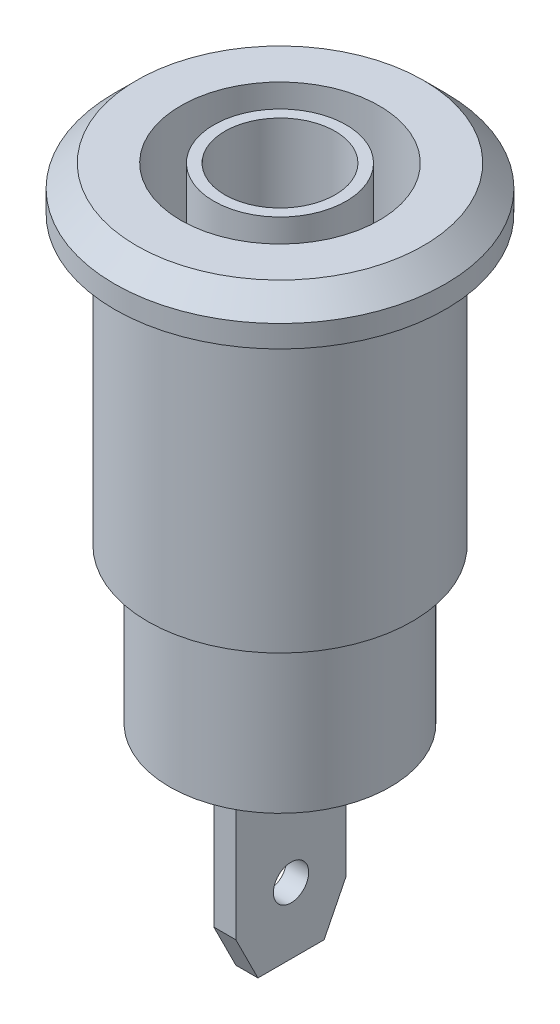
from build123d import *

# Parameters (mm, degrees)
CHANFREIN1_SIZE         = 1
ESQUISSE2_R             = 4.5
ENL_V_MAT_EXTRU_1_DEPTH = 12
ESQUISSE3_R             = 3
BOSS_EXTRU_1_DEPTH      = 12
ESQUISSE4_R             = 2.5
ENL_V_MAT_EXTRU_2_DEPTH = 12
ESQUISSE5_W             = 5
ESQUISSE5_H             = 9
BOSS_EXTRU_2_DEPTH      = 1
ENL_V_MAT_EXTRU_3_DEPTH = 1
ENL_V_MAT_EXTRU_4_DEPTH = 1
ESQUISSE8_R             = 0.8
ENL_V_MAT_EXTRU_5_DEPTH = 1


with BuildPart() as part:
    # Esquisse1 → Base-R_volution (revolve)
    with BuildSketch(Plane(origin=(0, 0, 0), x_dir=(0, 0, -1), z_dir=(1, 0, 0)), mode=Mode.PRIVATE) as base_r_volution_sk:
        Polygon((0, 0), (7.5, 0), (7.5, -2), (6, -2), (6, -15), (5, -15), (5, -22), (0, -22), align=None)
    revolve(base_r_volution_sk.sketch.rotate(Axis((0, 10, 0), (0, -1, 0)), 180), axis=Axis((0, 10, 0), (0, -1, 0)))

    # Chanfrein1
    chanfrein1_edges = [part.edges().sort_by_distance(p)[0] for p in [
        (0, 0, -7.5),
    ]]
    chamfer(chanfrein1_edges, length=CHANFREIN1_SIZE)

    # Esquisse2 → Enl_v. mat.-Extru.1 (cut)
    with BuildSketch(Plane(origin=(0, 0, 0), x_dir=(-1, 0, 0), z_dir=(0, 1, 0))):
        with Locations(Location((0, 0, 0), (0, 0, 90))):
            Circle(ESQUISSE2_R)
    extrude(amount=-ENL_V_MAT_EXTRU_1_DEPTH, mode=Mode.SUBTRACT)

    # Esquisse3 → Boss.-Extru.1 (add)
    with BuildSketch(Plane(origin=(0, -12, 0), x_dir=(-1, 0, 0), z_dir=(0, 1, 0))):
        with Locations(Location((0, 0, 0), (0, 0, 90))):
            Circle(ESQUISSE3_R)
    extrude(amount=BOSS_EXTRU_1_DEPTH)

    # Esquisse4 → Enl_v. mat.-Extru.2 (cut)
    with BuildSketch(Plane(origin=(0, 0, 0), x_dir=(-1, 0, 0), z_dir=(0, 1, 0))):
        with Locations(Location((0, 0, 0), (0, 0, 90))):
            Circle(ESQUISSE4_R)
    extrude(amount=-ENL_V_MAT_EXTRU_2_DEPTH, mode=Mode.SUBTRACT)

    # Esquisse5 → Boss.-Extru.2 (add)
    with BuildSketch(Plane(origin=(0.5, 0, 0), x_dir=(0, 0, -1), z_dir=(1, 0, 0))):
        with Locations((0, -26.5)):
            Rectangle(ESQUISSE5_W, ESQUISSE5_H)
    extrude(amount=-BOSS_EXTRU_2_DEPTH)

    # Esquisse6 → Enl_v. mat.-Extru.3 (cut)
    with BuildSketch(Plane(origin=(0.5, 0, 0), x_dir=(0, 0, -1), z_dir=(1, 0, 0))):
        Polygon((-2.5, -29), (-1.5, -31), (-2.5, -31), align=None)
    extrude(amount=-ENL_V_MAT_EXTRU_3_DEPTH, mode=Mode.SUBTRACT)

    # Esquisse7 → Enl_v. mat.-Extru.4 (cut)
    with BuildSketch(Plane(origin=(0.5, 0, 0), x_dir=(0, 0, -1), z_dir=(1, 0, 0))):
        Polygon((2.5, -31), (2.5, -29), (1.5, -31), align=None)
    extrude(amount=-ENL_V_MAT_EXTRU_4_DEPTH, mode=Mode.SUBTRACT)

    # Esquisse8 → Enl_v. mat.-Extru.5 (cut)
    with BuildSketch(Plane(origin=(0.5, 0, 0), x_dir=(0, 0, -1), z_dir=(1, 0, 0))):
        with Locations((0, -28)):
            Circle(ESQUISSE8_R)
    extrude(amount=-ENL_V_MAT_EXTRU_5_DEPTH, mode=Mode.SUBTRACT)


solid = part.part
